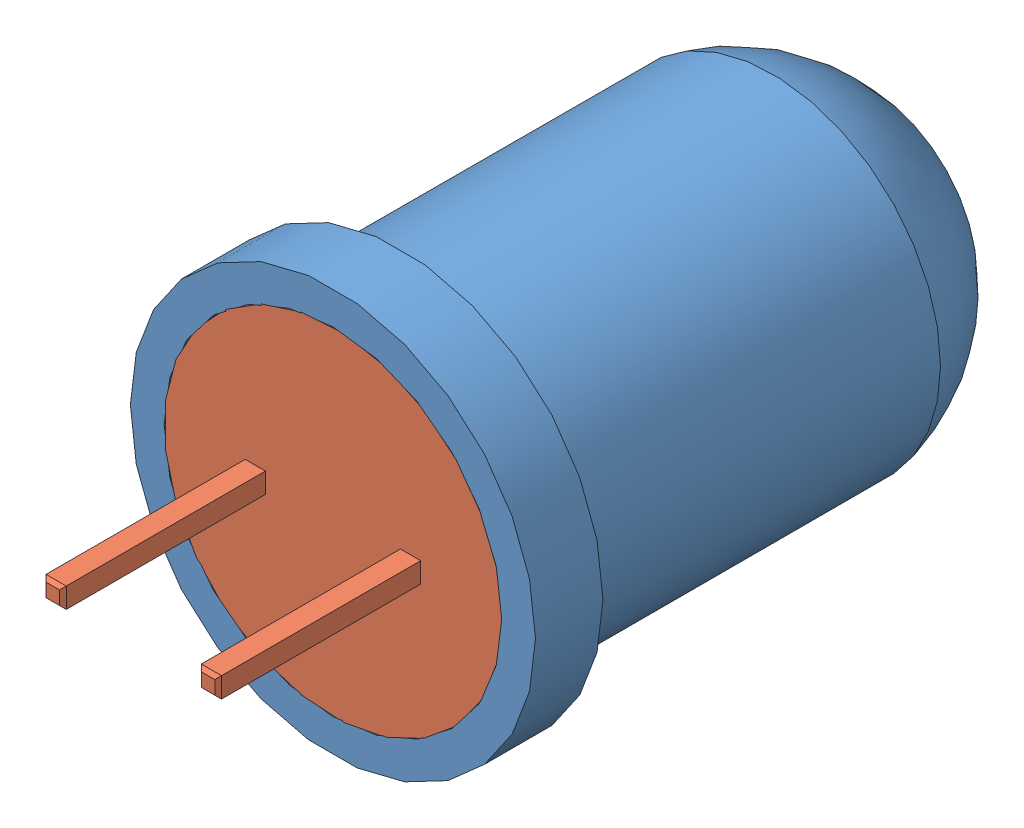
SolidWorks assembly led orange.SLDASM, configuration Défaut (file format 3100). Lengths in mm.
Overall size (6 6 11.5).
2 component instances, 2 part files, 4 mates.
Components (placement in the parent):
- verre led orange-1: verre led orange.SLDPRT [Défaut] at origin size (6 6 8.5)
- interieur led orange-1: interieur led orange.SLDPRT [Défaut] at origin size (5 5 8.5)
Mates (geometry in assembly coordinates):
- Sur place1: in place: plane of ? through (0 0 0) normal (0 0 1); unknown of ?
- Coïncidente1: coincident aligned: plane of verre led orange-1; plane of interieur led orange-1
- Coïncidente2: coincident aligned: moOrthogonalPlaneRef_w of verre led orange-1; plane of interieur led orange-1
- Coïncidente3: coincident anti-aligned: moOrthogonalPlaneRef_w of verre led orange-1; plane of interieur led orange-1
